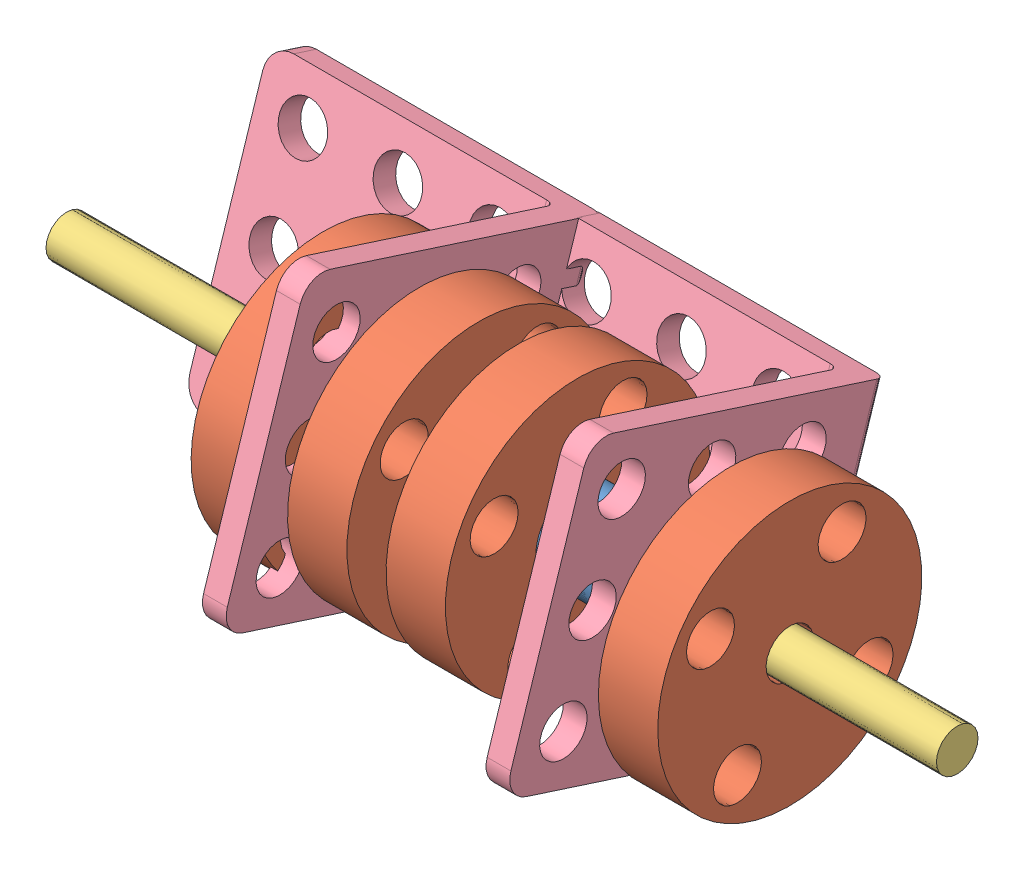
SolidWorks assembly 手终极.SLDASM, configuration 默认 (file format 10000). Lengths in mm.
Overall size (75 31.85 32.93).
18 component instances, 4 part files, 24 mates.
Components (placement in the parent):
- 法-1: 法.SLDASM [默认] at (155.9814 475.7631 153.2631) x (0 0.881823 0.471581) z (0 -0.471581 0.881823) size (30.79 9 30.79)
  - 法老你-1: 法老你.SLDPRT [默认] at (18.6123 16.7894 28.8956) size (7 4 7)
  - 法兰轴2-2: 法兰轴2.SLDPRT [默认] at (-20.3439 25.7894 14.6838) x (-0.837169 0 -0.546944) z (-0.546944 0 0.837169) size (22.24 5 22.24)
- 法老你-1: 法老你.SLDPRT [默认] at (127.1921 461.5862 178.6075) x (0 -0.297729 0.95465) z (0 -0.95465 -0.297729) size (7 4 7)
- 柱子-1: 柱子.SLDPRT [默认] at (92.1807 474.5743 173.5443) x (0 -1 0) z (0 0 1) size (3.5 75 3.5)
- 法老你-2: 法老你.SLDPRT [默认] at (123.9903 468.4386 159.5141) x (0 -0.977488 -0.210989) z (0 0.210989 -0.977488) size (7 4 7)
- 搞了半天的90度折角件-2: 搞了半天的90度折角件.SLDPRT [默认] at (94.1921 482.5809 155.8019) x (1 0 0) z (0 -0.951742 0.3069) size (26 26 24)
- 法-2: 法.SLDASM [默认] at (127.2882 466.5869 190.2294) x (0 0.99999 -0.004455) z (0 -0.004455 -0.99999) size (30.79 9 30.79)
  - 法老你-1: 法老你.SLDPRT [默认] at (18.6123 16.7894 28.8956) size (7 4 7)
  - 法兰轴2-2: 法兰轴2.SLDPRT [默认] at (-20.3439 25.7894 14.6838) x (-0.837169 0 -0.546944) z (-0.546944 0 0.837169) size (22.24 5 22.24)
- 法老你-3: 法老你.SLDPRT [默认] at (142.0776 488.6818 179.9577) x (0 0.929781 -0.368113) z (0 0.368113 0.929781) size (7 4 7)
- 法-3: 法.SLDASM [默认] at (147.6856 494.7943 169.9465) x (0 -0.322566 0.946547) z (0 -0.946547 -0.322566) size (30.79 9 30.79)
  - 法老你-1: 法老你.SLDPRT [默认] at (18.6123 16.7894 28.8956) size (7 4 7)
  - 法兰轴2-2: 法兰轴2.SLDPRT [默认] at (-20.3439 25.7894 14.6838) x (-0.837169 0 -0.546944) z (-0.546944 0 0.837169) size (22.24 5 22.24)
- 搞了半天的90度折角件-3: 搞了半天的90度折角件.SLDPRT [默认] at (144.0776 467.7185 187.9128) x (0 -0.3069 -0.951742) z (0 0.951742 -0.3069) size (26 26 24)
- 法-4: 法.SLDASM [默认] at (92.9867 473.6924 192.2777) x (0 0.926785 -0.375591) z (0 -0.375591 -0.926785) size (30.79 9 30.79)
  - 法老你-1: 法老你.SLDPRT [默认] at (18.6123 16.7894 28.8956) size (7 4 7)
  - 法兰轴2-2: 法兰轴2.SLDPRT [默认] at (-20.3439 25.7894 14.6838) x (-0.837169 0 -0.546944) z (-0.546944 0 0.837169) size (22.24 5 22.24)
Mates (geometry in assembly coordinates):
- 同心6: concentric anti-aligned: circle of 法-1/法老你-1; circle of 柱子-1
- 同心7: concentric anti-aligned: circle of 法老你-1; circle of 柱子-1
- 同心8: concentric anti-aligned: circle of 柱子-1; circle of 法老你-2
- 锁定2: lock: unknown of 法老你-1; unknown of 法老你-2
- 同心10: concentric aligned: circle of ?; circle of 搞了半天的90度折角件-2
- 同心11: concentric aligned: circle of 法-1/法老你-1; cylinder of 搞了半天的90度折角件-2 through (120.1921 475.4566 172.8091) axis (-1 0 0) radius 2
- 重合14: coincident anti-aligned: plane of ? through (118.1921 475.4566 172.8091) normal (1 0 0); plane of 搞了半天的90度折角件-2 through (118.1921 460.2272 180.2969) normal (-1 0 0)
- 同心13: concentric aligned: circle of 柱子-1; circle of ?
- 同心16: concentric anti-aligned: circle of 搞了半天的90度折角件-2; circle of ?
- 同心17: concentric anti-aligned: circle of 柱子-1; circle of 法老你-3
- 锁定3: lock: unknown of 柱子-1; unknown of 法老你-3
- 同心19: concentric anti-aligned: circle of 柱子-1; circle of 法-3/法老你-1
- 同心20: concentric anti-aligned: circle of ?; circle of ?
- 距离4: distance = 10.1695 mm anti-aligned: plane of ? through (145.3616 475.4566 172.8091) normal (-1 0 0); plane of ? through (135.1921 475.4566 172.8091) normal (1 0 0)
- 同心21: concentric anti-aligned: circle of 柱子-1; circle of 搞了半天的90度折角件-3
- 同心23: concentric aligned: circle of ?; circle of 搞了半天的90度折角件-3
- 重合25: coincident anti-aligned: plane of ? through (150.3616 475.4566 172.8091) normal (1 0 0); plane of 搞了半天的90度折角件-3 through (150.3616 467.9688 157.5797) normal (-1 0 0)
- 同心27: concentric aligned: circle of 柱子-1; circle of 法-4/法老你-1
- 同心28: concentric anti-aligned: circle of 搞了半天的90度折角件-3; circle of ?
- 重合29: coincident anti-aligned: plane of 搞了半天的90度折角件-3 through (152.3616 467.9688 157.5797) normal (1 0 0); plane of ? through (152.3616 475.4566 172.8091) normal (-1 0 0)
- 同心31: concentric anti-aligned: circle of 柱子-1; circle of 法-2/法兰轴2-2
- 平行1: parallel anti-aligned: line of 搞了半天的90度折角件-2 through (94.1921 480.6774 156.4157) axis (0 -0.951742 0.3069); line of 搞了半天的90度折角件-3 through (118.0776 461.6426 162.5537) axis (0 0.951742 -0.3069)
- 重合35: coincident anti-aligned: plane of 法老你-3 through (142.0776 475.4566 172.8091) normal (1 0 0); plane of 搞了半天的90度折角件-3 through (142.0776 467.7185 187.9128) normal (-1 0 0)
- 重合36: coincident anti-aligned: plane of 法-2/法老你-1 through (144.0776 475.4566 172.8091) normal (-1 0 0); plane of 搞了半天的90度折角件-3 through (144.0776 467.7185 187.9128) normal (1 0 0)
